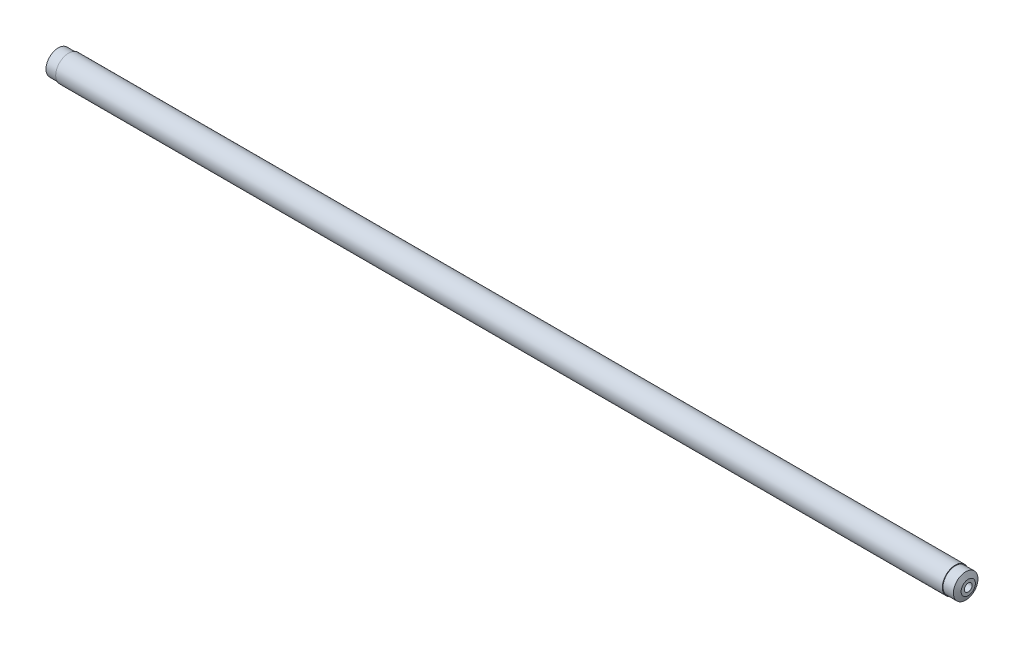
from build123d import *

# Parameters (mm, degrees)
DIAM_TRE_DU_PER_AGE_M6_0_6_000000_1_D = 6


with BuildPart() as part:
    # Esquisse1 → R_volution1 (revolve)
    with BuildSketch(Plane.XY, mode=Mode.PRIVATE) as r_volution1_sk:
        Polygon((-342, 10), (342, 10), (342, 9.5), (350, 9.5), (352, 5.5), (352, 0), (-352, 0), (-352, 5.5), (-350, 9.5), (-342, 9.5), align=None)
    revolve(r_volution1_sk.sketch.rotate(Axis((352, 0, 0), (-1, 0, 0)), 90), axis=Axis((352, 0, 0), (-1, 0, 0)))

    # Diam_tre du per_age M6.0 _6.000000_1 (through all)
    with Locations(Plane.ZY.offset(352)):
        with Locations((0, 0)):
            Hole(DIAM_TRE_DU_PER_AGE_M6_0_6_000000_1_D / 2)


solid = part.part
